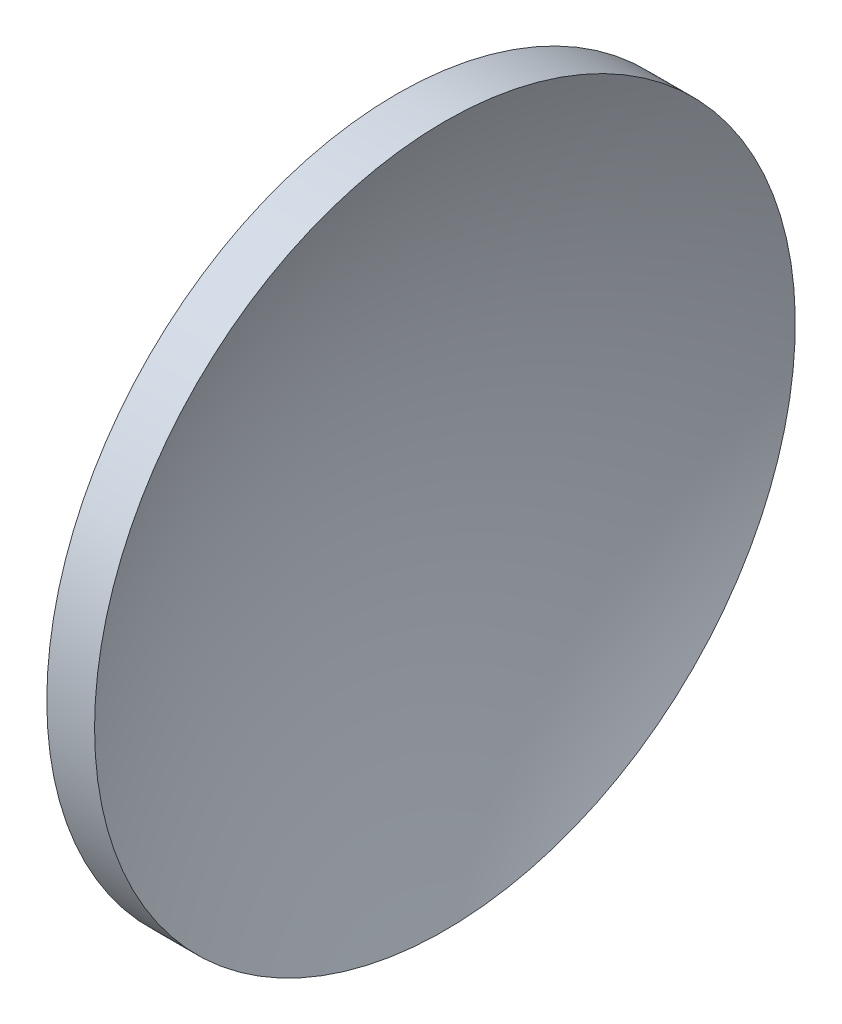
ISO-10303-21;
HEADER;
FILE_DESCRIPTION(('STEP AP214'),'2;1');
FILE_NAME('part.step','',(''),(''),'','','');
FILE_SCHEMA(('AUTOMOTIVE_DESIGN { 1 0 10303 214 1 1 1 1 }'));
ENDSEC;
DATA;
#1=APPLICATION_CONTEXT('core data for automotive mechanical design processes');
#2=APPLICATION_PROTOCOL_DEFINITION('international standard','automotive_design',2000,#1);
#3=PRODUCT_CONTEXT('',#1,'mechanical');
#4=PRODUCT('Part','Part','',(#3));
#5=PRODUCT_RELATED_PRODUCT_CATEGORY('part','',(#4));
#6=PRODUCT_DEFINITION_FORMATION('','',#4);
#7=PRODUCT_DEFINITION_CONTEXT('part definition',#1,'design');
#8=PRODUCT_DEFINITION('design','',#6,#7);
#9=PRODUCT_DEFINITION_SHAPE('','',#8);
#10=(LENGTH_UNIT() NAMED_UNIT(*) SI_UNIT(.MILLI.,.METRE.));
#11=(NAMED_UNIT(*) PLANE_ANGLE_UNIT() SI_UNIT($,.RADIAN.));
#12=(NAMED_UNIT(*) SI_UNIT($,.STERADIAN.) SOLID_ANGLE_UNIT());
#13=UNCERTAINTY_MEASURE_WITH_UNIT(LENGTH_MEASURE(1.E-05),#10,'distance_accuracy_value','');
#14=(GEOMETRIC_REPRESENTATION_CONTEXT(3) GLOBAL_UNCERTAINTY_ASSIGNED_CONTEXT((#13)) GLOBAL_UNIT_ASSIGNED_CONTEXT((#10,
#11,#12)) REPRESENTATION_CONTEXT('',''));
#15=CARTESIAN_POINT('',(0.,0.,0.));
#16=DIRECTION('',(0.,0.,1.));
#17=DIRECTION('',(1.,0.,0.));
#18=AXIS2_PLACEMENT_3D('',#15,#16,#17);
#19=CARTESIAN_POINT('',(0.191256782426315,2.05352808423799E-12,0.));
#20=CARTESIAN_POINT('',(0.191256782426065,0.0837653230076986,0.));
#21=CARTESIAN_POINT('',(0.191925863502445,0.255102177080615,0.));
#22=CARTESIAN_POINT('',(0.194936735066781,0.638372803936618,0.));
#23=CARTESIAN_POINT('',(0.202963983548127,0.981436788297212,0.));
#24=CARTESIAN_POINT('',(0.215001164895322,1.4138335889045,0.));
#25=CARTESIAN_POINT('',(0.231042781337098,1.79605162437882,0.));
#26=CARTESIAN_POINT('',(0.251083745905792,2.20656063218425,0.));
#27=CARTESIAN_POINT('',(0.275114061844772,2.60116661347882,0.));
#28=CARTESIAN_POINT('',(0.31013071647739,3.10365160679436,0.));
#29=CARTESIAN_POINT('',(0.360087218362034,3.70095259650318,0.));
#30=CARTESIAN_POINT('',(0.429901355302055,4.3998755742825,0.));
#31=CARTESIAN_POINT('',(0.525361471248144,5.1950051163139,0.));
#32=CARTESIAN_POINT('',(0.636372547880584,5.98916807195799,0.));
#33=CARTESIAN_POINT('',(0.762731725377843,6.78038829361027,0.));
#34=CARTESIAN_POINT('',(0.904309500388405,7.56946001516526,0.));
#35=CARTESIAN_POINT('',(1.06080800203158,8.35536774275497,0.));
#36=CARTESIAN_POINT('',(1.23215690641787,9.13850498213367,0.));
#37=CARTESIAN_POINT('',(1.41787103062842,9.91794581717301,0.));
#38=CARTESIAN_POINT('',(1.6181008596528,10.6943742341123,0.));
#39=CARTESIAN_POINT('',(1.87098906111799,11.60719212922,0.));
#40=CARTESIAN_POINT('',(2.14486612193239,12.5157882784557,0.));
#41=CARTESIAN_POINT('',(2.43693214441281,13.4154339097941,0.));
#42=CARTESIAN_POINT('',(2.75031880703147,14.3130791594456,0.));
#43=CARTESIAN_POINT('',(3.02457735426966,15.0610217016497,0.));
#44=CARTESIAN_POINT('',(3.38986916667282,16.0038163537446,0.));
#45=CARTESIAN_POINT('',(3.76314166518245,16.9151815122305,0.));
#46=CARTESIAN_POINT('',(4.17649083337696,17.858733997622,0.));
#47=CARTESIAN_POINT('',(4.53533224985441,18.642365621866,0.));
#48=CARTESIAN_POINT('',(4.82176545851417,19.2402009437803,0.));
#49=CARTESIAN_POINT('',(5.03259592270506,19.6782494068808,0.));
#50=CARTESIAN_POINT('',(5.28828457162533,20.1855478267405,0.));
#51=CARTESIAN_POINT('',(5.39757169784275,20.4010339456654,0.));
#52=CARTESIAN_POINT('',(5.47422449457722,20.550000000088,0.));
#53=B_SPLINE_CURVE_WITH_KNOTS('',4,(#19,#20,#21,#22,#23,#24,#25,#26,#27,#28,#29,#30,#31,#32,#33,
#34,#35,#36,#37,#38,#39,#40,#41,#42,#43,#44,#45,#46,#47,#48,#49,#50,#51,#52),.UNSPECIFIED.,.F.,
.F.,(5,1,1,1,1,1,1,1,1,1,1,1,1,1,1,1,1,1,1,1,1,1,1,1,1,1,1,1,1,1,5),(0.0802430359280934,
0.0958834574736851,0.111523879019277,0.127164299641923,0.142804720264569,0.15844514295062,
0.174085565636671,0.189725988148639,0.205366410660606,0.236647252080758,0.267928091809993,
0.299208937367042,0.330489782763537,0.361770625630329,0.393051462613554,0.42433230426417,
0.455613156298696,0.486894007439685,0.518174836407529,0.549455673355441,0.603577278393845,
0.63485812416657,0.666138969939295,0.697419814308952,0.728700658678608,0.791262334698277,
0.822543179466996,0.853824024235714,0.869464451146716,0.885104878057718,0.916385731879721),.UNSPECIFIED.);
#54=CARTESIAN_POINT('',(-2.5,1.38669457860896E-12,0.));
#55=DIRECTION('',(-1.,0.,0.));
#56=AXIS1_PLACEMENT('',#54,#55);
#57=SURFACE_OF_REVOLUTION('',#53,#56);
#58=CARTESIAN_POINT('',(5.47422449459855,1.38669457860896E-12,0.));
#59=DIRECTION('',(-1.,0.,0.));
#60=DIRECTION('',(0.,0.,1.));
#61=AXIS2_PLACEMENT_3D('',#58,#59,#60);
#62=CIRCLE('',#61,20.5499999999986);
#63=CARTESIAN_POINT('',(5.47422449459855,1.38669457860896E-12,20.5499999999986));
#64=VERTEX_POINT('',#63);
#65=EDGE_CURVE('E11',#64,#64,#62,.T.);
#66=ORIENTED_EDGE('',*,*,#65,.F.);
#67=EDGE_LOOP('',(#66));
#68=FACE_BOUND('',#67,.T.);
#69=CARTESIAN_POINT('',(0.191256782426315,1.38669457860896E-12,0.));
#70=VERTEX_POINT('',#69);
#71=VERTEX_LOOP('',#70);
#72=FACE_BOUND('',#71,.T.);
#73=ADVANCED_FACE('F33',(#68,#72),#57,.T.);
#74=CARTESIAN_POINT('',(-2.5,1.38669457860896E-12,0.));
#75=DIRECTION('',(-1.,0.,0.));
#76=DIRECTION('',(0.,0.,1.));
#77=AXIS2_PLACEMENT_3D('',#74,#75,#76);
#78=CYLINDRICAL_SURFACE('',#77,20.5499999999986);
#79=CARTESIAN_POINT('',(2.67312517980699,1.38669457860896E-12,0.));
#80=DIRECTION('',(-1.,0.,0.));
#81=DIRECTION('',(0.,0.,1.));
#82=AXIS2_PLACEMENT_3D('',#79,#80,#81);
#83=CIRCLE('',#82,20.5499999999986);
#84=CARTESIAN_POINT('',(2.67312517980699,1.38669457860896E-12,20.5499999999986));
#85=VERTEX_POINT('',#84);
#86=EDGE_CURVE('E41',#85,#85,#83,.T.);
#87=ORIENTED_EDGE('',*,*,#86,.F.);
#88=EDGE_LOOP('',(#87));
#89=FACE_BOUND('',#88,.T.);
#90=ORIENTED_EDGE('',*,*,#65,.T.);
#91=EDGE_LOOP('',(#90));
#92=FACE_BOUND('',#91,.T.);
#93=ADVANCED_FACE('F50',(#89,#92),#78,.T.);
#94=CARTESIAN_POINT('',(2.67312517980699,20.55,0.));
#95=CARTESIAN_POINT('',(2.5978172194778,20.400535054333,0.));
#96=CARTESIAN_POINT('',(2.4908541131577,20.1851235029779,0.));
#97=CARTESIAN_POINT('',(2.24485053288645,19.6864106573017,0.));
#98=CARTESIAN_POINT('',(1.94888120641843,19.0609904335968,0.));
#99=CARTESIAN_POINT('',(1.57862075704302,18.262253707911,0.));
#100=CARTESIAN_POINT('',(1.24093798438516,17.4853901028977,0.));
#101=CARTESIAN_POINT('',(0.84416208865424,16.5339451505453,0.));
#102=CARTESIAN_POINT('',(0.556371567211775,15.8038386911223,0.));
#103=CARTESIAN_POINT('',(0.268815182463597,15.045956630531,0.));
#104=CARTESIAN_POINT('',(0.000433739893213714,14.2974326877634,0.));
#105=CARTESIAN_POINT('',(-0.305367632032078,13.4020077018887,0.));
#106=CARTESIAN_POINT('',(-0.590106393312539,12.5053341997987,0.));
#107=CARTESIAN_POINT('',(-0.857237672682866,11.5997364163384,0.));
#108=CARTESIAN_POINT('',(-1.10384876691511,10.690324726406,0.));
#109=CARTESIAN_POINT('',(-1.29993829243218,9.91352236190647,0.));
#110=CARTESIAN_POINT('',(-1.48174716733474,9.1338897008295,0.));
#111=CARTESIAN_POINT('',(-1.64946871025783,8.35066304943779,0.));
#112=CARTESIAN_POINT('',(-1.80261387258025,7.56480617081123,0.));
#113=CARTESIAN_POINT('',(-1.94113610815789,6.77588986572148,0.));
#114=CARTESIAN_POINT('',(-2.06474321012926,5.98493739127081,0.));
#115=CARTESIAN_POINT('',(-2.17332104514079,5.19113435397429,0.));
#116=CARTESIAN_POINT('',(-2.26667447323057,4.3964520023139,0.));
#117=CARTESIAN_POINT('',(-2.33494040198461,3.69798347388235,0.));
#118=CARTESIAN_POINT('',(-2.38378469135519,3.10111038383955,0.));
#119=CARTESIAN_POINT('',(-2.41802018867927,2.59900425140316,0.));
#120=CARTESIAN_POINT('',(-2.44151341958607,2.20470961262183,0.));
#121=CARTESIAN_POINT('',(-2.46110596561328,1.79452959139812,0.));
#122=CARTESIAN_POINT('',(-2.47678818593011,1.41262975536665,0.));
#123=CARTESIAN_POINT('',(-2.4885554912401,0.980595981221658,0.));
#124=CARTESIAN_POINT('',(-2.49640263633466,0.637825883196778,0.));
#125=CARTESIAN_POINT('',(-2.49934593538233,0.254865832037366,0.));
#126=CARTESIAN_POINT('',(-2.49999999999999,0.0836824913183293,0.));
#127=CARTESIAN_POINT('',(-2.5,2.08007153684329E-12,0.));
#128=B_SPLINE_CURVE_WITH_KNOTS('',4,(#94,#95,#96,#97,#98,#99,#100,#101,#102,#103,#104,#105,#106,
#107,#108,#109,#110,#111,#112,#113,#114,#115,#116,#117,#118,#119,#120,#121,#122,#123,#124,#125,
#126,#127),.UNSPECIFIED.,.F.,.F.,(5,1,1,1,1,1,1,1,1,1,1,1,1,1,1,1,1,1,1,1,1,1,1,1,1,1,1,1,1,1,
5),(0.0803615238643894,0.111662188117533,0.127312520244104,0.142962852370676,0.20556414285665,
0.23686480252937,0.268165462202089,0.299466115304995,0.330766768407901,0.362067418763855,
0.393368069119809,0.446886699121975,0.478187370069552,0.509488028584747,0.540788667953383,
0.572089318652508,0.603389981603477,0.634690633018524,0.665991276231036,0.697291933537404,
0.728592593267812,0.759893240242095,0.791193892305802,0.806844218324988,0.822494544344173,
0.838144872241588,0.853795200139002,0.869445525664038,0.885095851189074,0.900746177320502,
0.916396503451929),.UNSPECIFIED.);
#129=CARTESIAN_POINT('',(-2.5,1.38669457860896E-12,0.));
#130=DIRECTION('',(-1.,0.,0.));
#131=AXIS1_PLACEMENT('',#129,#130);
#132=SURFACE_OF_REVOLUTION('',#128,#131);
#133=CARTESIAN_POINT('',(-2.5,1.38669457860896E-12,0.));
#134=VERTEX_POINT('',#133);
#135=VERTEX_LOOP('',#134);
#136=FACE_BOUND('',#135,.T.);
#137=ORIENTED_EDGE('',*,*,#86,.T.);
#138=EDGE_LOOP('',(#137));
#139=FACE_BOUND('',#138,.T.);
#140=ADVANCED_FACE('F47',(#136,#139),#132,.T.);
#141=CLOSED_SHELL('',(#73,#93,#140));
#142=MANIFOLD_SOLID_BREP('B2',#141);
#143=ADVANCED_BREP_SHAPE_REPRESENTATION('',(#18,#142),#14);
#144=SHAPE_DEFINITION_REPRESENTATION(#9,#143);
ENDSEC;
END-ISO-10303-21;
